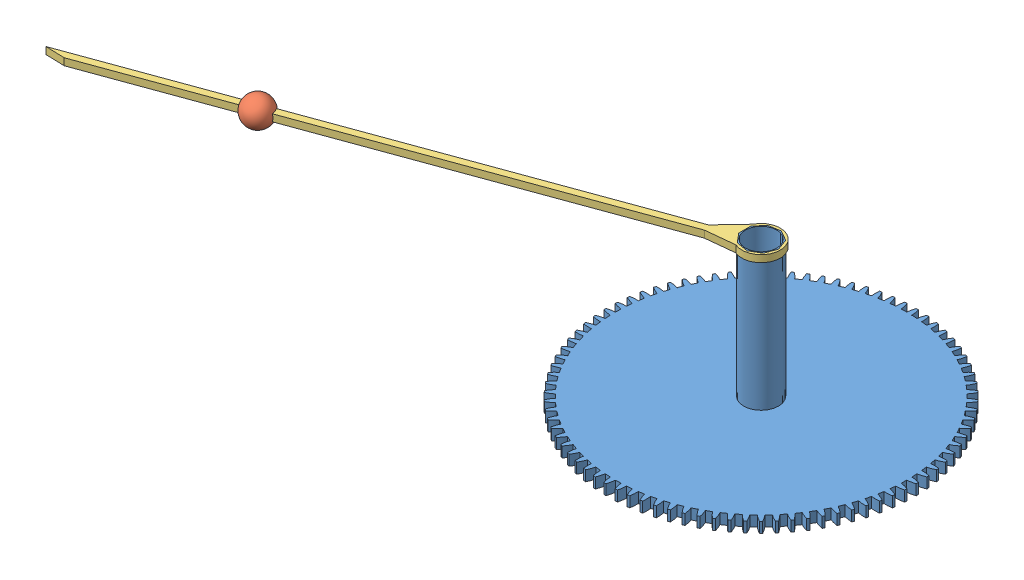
SolidWorks assembly Pointer Assembly Jupiter.SLDASM, configuration Default (file format 6000). Lengths in mm.
Overall size (98.11 22.5 51.94).
3 component instances, 3 part files, 6 mates.
Components (placement in the parent):
- Gear 86T Axle Jupiter Gear 4-1: Gear 86T Axle Jupiter Gear 4.SLDPRT [Default] at (-37.9812 -9.404 19.2976) size (44 21 44)
- Orb Jupiter-1: Orb Jupiter.SLDPRT [Default] at (-90.5129 11.096 38.9496) x (0 1 0) z (-0.939693 0 0.34202) size (4 4 3.87)
- Pointer Jupiter-1: Pointer Jupiter.SLDPRT [Default] at (-37.9812 10.596 19.2976) x (-0.939693 0 0.34202) z (-0.34202 0 -0.939693) size (82.75 1 5.5)
Mates (geometry in assembly coordinates):
- Coincident1: coincident: plane of Gear 86T Axle Jupiter Gear 4-1 through (-37.9812 11.596 19.2976) normal (0 1 0); plane of Pointer Jupiter-1 through (-37.9812 11.596 19.2976) normal (0 1 0)
- Concentric1: concentric: cylinder of Gear 86T Axle Jupiter Gear 4-1 through (-37.9812 11.596 19.2976) axis (0 -1 0) radius 2.5; cylinder of Pointer Jupiter-1 through (-37.9812 11.596 19.2976) axis (0 -1 0) radius 2.75
- Coincident2: coincident anti-aligned: plane of Gear 86T Axle Jupiter Gear 4-1 through (-35.7736 10.596 18.4941) normal (0.939693 0 -0.34202); plane of Pointer Jupiter-1 through (-35.4812 11.596 19.2976) normal (-0.939693 0 0.34202)
- Coincident3: coincident: plane of Orb Jupiter-1 through (-88.4616 10.596 38.7351) normal (-0.34202 0 -0.939693); plane of Pointer Jupiter-1 through (-110.4653 11.596 46.7438) normal (0.34202 0 0.939693)
- Coincident4: coincident: plane of Orb Jupiter-1 through (-88.4616 10.596 38.7351) normal (0 1 0); plane of Pointer Jupiter-1 through (-37.9812 10.596 19.2976) normal (0 -1 0)
- Coincident5: coincident: point of Orb Jupiter-1; point of Pointer Jupiter-1
